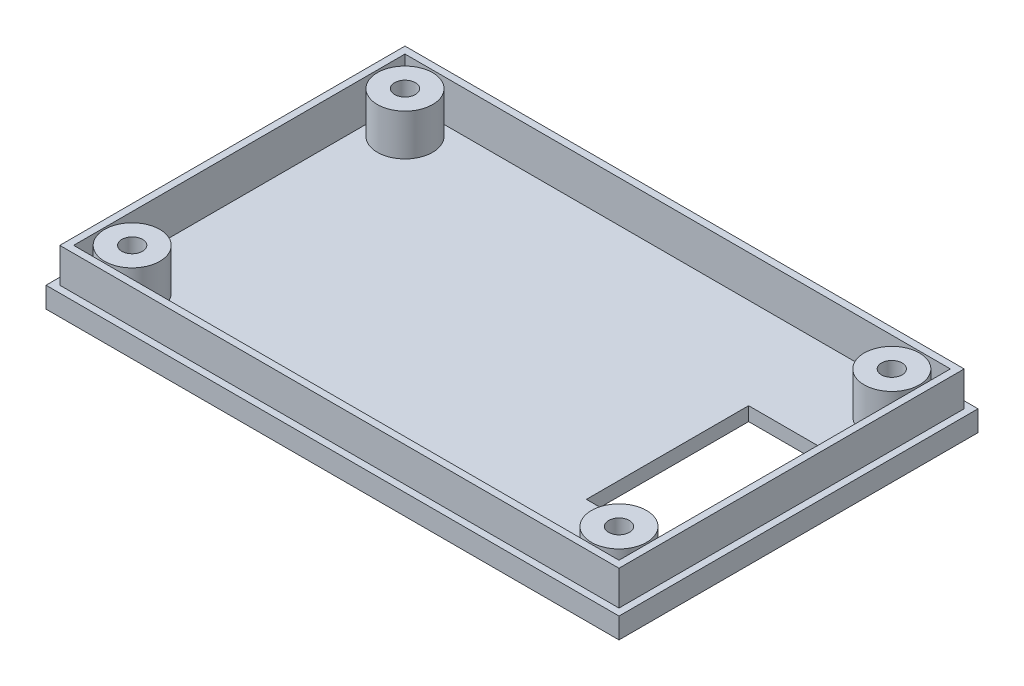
from build123d import *

# Parameters (mm, degrees)
SKETCH2_W            = 83
SKETCH2_H            = 52
BOSS_EXTRUDE1_DEPTH  = 2
SKETCH4_W            = 83
SKETCH4_H            = 52
SKETCH4_W_2          = 79
SKETCH4_H_2          = 48
BOSS_EXTRUDE5_DEPTH  = 20
SKETCH5_W            = 81
SKETCH5_H            = 50
CUT_EXTRUDE1_DEPTH   = 5
SKETCH10_R           = 4
BOSS_EXTRUDE31_DEPTH = 14.5
SKETCH11_R           = 4
BOSS_EXTRUDE32_DEPTH = 14.5
SKETCH12_R           = 1.5
CUT_EXTRUDE3_DEPTH   = 20
SKETCH13_R           = 2.5
CUT_EXTRUDE4_DEPTH   = 14.5
SKETCH17_W           = 83
SKETCH17_H           = 52
CUT_EXTRUDE8_DEPTH   = 14
SKETCH18_R           = 3.338654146
SKETCH18_R_2         = 3.122650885
SKETCH18_R_3         = 3.122487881
SKETCH18_R_4         = 2.901838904
BOSS_EXTRUDE34_DEPTH = 8
SKETCH19_W           = 83
SKETCH19_H           = 52
CUT_EXTRUDE9_DEPTH   = 5
SKETCH20_W           = 13
SKETCH20_H           = 23.5
CUT_EXTRUDE10_DEPTH  = 5
SKETCH21_R           = 1.5
CUT_EXTRUDE11_DEPTH  = 3


with BuildPart() as part:
    # Sketch2 → Boss-Extrude1 (new body)
    with BuildSketch(Plane(origin=(0, 0, 0), x_dir=(1, 0, 0), z_dir=(0, 1, 0))):
        with Locations((25.558581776, 0.23866815)):
            Rectangle(SKETCH2_W, SKETCH2_H)
    extrude(amount=BOSS_EXTRUDE1_DEPTH)

    # Sketch4 → Boss-Extrude5 (add)
    with BuildSketch(Plane(origin=(0, 2, 0), x_dir=(1, 0, 0), z_dir=(0, 1, 0))):
        with Locations((25.558581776, 0.23866815)):
            Rectangle(SKETCH4_W, SKETCH4_H)
        with Locations((25.558581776, 0.23866815)):
            Rectangle(SKETCH4_W_2, SKETCH4_H_2, mode=Mode.SUBTRACT)
    extrude(amount=BOSS_EXTRUDE5_DEPTH)

    # Sketch5 → Cut-Extrude1 (cut)
    with BuildSketch(Plane(origin=(0, 22, 0), x_dir=(1, 0, 0), z_dir=(0, 1, 0))):
        with Locations((25.558581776, 0.23866815)):
            Rectangle(SKETCH5_W, SKETCH5_H)
    extrude(amount=-CUT_EXTRUDE1_DEPTH, mode=Mode.SUBTRACT)

    # Sketch10 → Boss-Extrude31 (add)
    with BuildSketch(Plane(origin=(0, 2, 0), x_dir=(1, 0, 0), z_dir=(0, 1, 0))):
        with Locations(Location((-9.604667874, 19.901917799, 0), (0, 0, 90))):
            Circle(SKETCH10_R)
    extrude(amount=BOSS_EXTRUDE31_DEPTH)

    # Sketch11 → Boss-Extrude32 (add)
    with BuildSketch(Plane(origin=(0, 2, 0), x_dir=(1, 0, 0), z_dir=(0, 1, 0))):
        with Locations(Location((-9.698777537, -19.518691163, 0), (0, 0, 90))):
            Circle(SKETCH11_R)
        with Locations(Location((60.815941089, -19.518691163, 0), (0, 0, 90))):
            Circle(SKETCH11_R)
        with Locations(Location((60.815941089, 19.996027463, 0), (0, 0, 90))):
            Circle(SKETCH11_R)
    extrude(amount=BOSS_EXTRUDE32_DEPTH)

    # Sketch12 → Cut-Extrude3 (cut)
    with BuildSketch(Plane(origin=(0, 16.5, 0), x_dir=(1, 0, 0), z_dir=(0, 1, 0))):
        with Locations(Location((-9.698777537, 19.996027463, 0), (0, 0, 270))):
            Circle(SKETCH12_R)
        with Locations(Location((-9.698777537, -19.518691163, 0), (0, 0, 270))):
            Circle(SKETCH12_R)
        with Locations(Location((60.815941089, -19.518691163, 0), (0, 0, 270))):
            Circle(SKETCH12_R)
        with Locations(Location((60.815941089, 19.996027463, 0), (0, 0, 270))):
            Circle(SKETCH12_R)
    extrude(amount=-CUT_EXTRUDE3_DEPTH, mode=Mode.SUBTRACT)

    # Sketch13 → Cut-Extrude4 (cut)
    with BuildSketch(Plane.XZ):
        with Locations(Location((-9.698777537, 19.518691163, 0), (0, 0, 270))):
            Circle(SKETCH13_R)
        with Locations(Location((60.815941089, 19.518691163, 0), (0, 0, 270))):
            Circle(SKETCH13_R)
        with Locations(Location((60.815941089, -19.996027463, 0), (0, 0, 270))):
            Circle(SKETCH13_R)
        with Locations(Location((-9.698777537, -19.996027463, 0), (0, 0, 270))):
            Circle(SKETCH13_R)
    extrude(amount=-CUT_EXTRUDE4_DEPTH, mode=Mode.SUBTRACT)

    # Sketch17 → Cut-Extrude8 (cut)
    with BuildSketch(Plane(origin=(0, 22, 0), x_dir=(1, 0, 0), z_dir=(0, 1, 0))):
        with Locations((25.558581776, 0.23866815)):
            Rectangle(SKETCH17_W, SKETCH17_H)
    extrude(amount=-CUT_EXTRUDE8_DEPTH, mode=Mode.SUBTRACT)

    # Sketch18 → Boss-Extrude34 (add)
    with BuildSketch(Plane(origin=(0, 8, 0), x_dir=(1, 0, 0), z_dir=(0, 1, 0))):
        with Locations((-9.91537592, 20.129131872)):
            Circle(SKETCH18_R)
        with Locations((-9.698777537, -19.518691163)):
            Circle(SKETCH18_R_2)
        with Locations((60.815941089, -19.518691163)):
            Circle(SKETCH18_R_3)
        with Locations((60.815941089, 19.996027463)):
            Circle(SKETCH18_R_4)
    extrude(amount=-BOSS_EXTRUDE34_DEPTH)

    # Sketch19 → Cut-Extrude9 (cut)
    with BuildSketch(Plane(origin=(0, 8, 0), x_dir=(1, 0, 0), z_dir=(0, 1, 0))):
        with Locations((25.558581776, 0.23866815)):
            Rectangle(SKETCH19_W, SKETCH19_H)
        Polygon((-14.941418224, 25.23866815), (-13.941418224, 25.23866815), (66.058581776, 25.23866815), (66.058581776, -23.76133185), (66.058581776, -24.765577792), (-14.941418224, -24.765577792), align=None, mode=Mode.SUBTRACT)
    extrude(amount=-CUT_EXTRUDE9_DEPTH, mode=Mode.SUBTRACT)

    # Sketch20 → Cut-Extrude10 (cut)
    with BuildSketch(Plane.XZ):
        with Locations((55.558581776, 0.736905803)):
            Rectangle(SKETCH20_W, SKETCH20_H)
    extrude(amount=-CUT_EXTRUDE10_DEPTH, mode=Mode.SUBTRACT)

    # Sketch21 → Cut-Extrude11 (cut)
    with BuildSketch(Plane(origin=(0, 8, 0), x_dir=(1, 0, 0), z_dir=(0, 1, 0))):
        with Locations(Location((60.815941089, -19.518691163, 0), (0, 0, 270))):
            Circle(SKETCH21_R)
        with Locations(Location((60.815941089, 19.996027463, 0), (0, 0, 270))):
            Circle(SKETCH21_R)
        with Locations(Location((-9.604667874, 19.901917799, 0), (0, 0, 270))):
            Circle(SKETCH21_R)
        with Locations(Location((-9.698777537, -19.518691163, 0), (0, 0, 270))):
            Circle(SKETCH21_R)
    extrude(amount=-CUT_EXTRUDE11_DEPTH, mode=Mode.SUBTRACT)


solid = part.part
